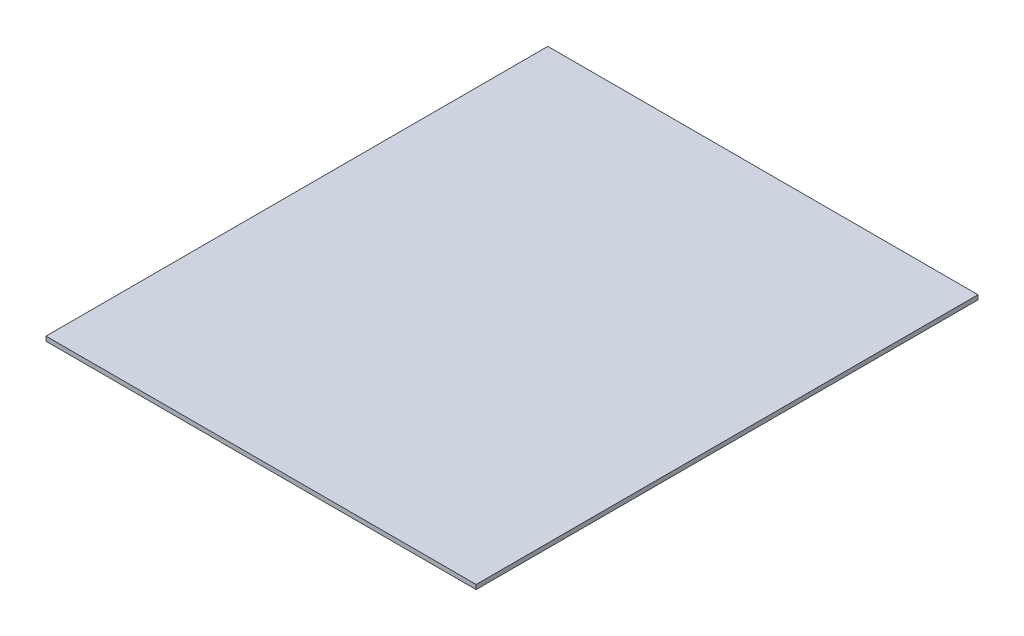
ISO-10303-21;
HEADER;
FILE_DESCRIPTION(('STEP AP214'),'2;1');
FILE_NAME('part.step','',(''),(''),'','','');
FILE_SCHEMA(('AUTOMOTIVE_DESIGN { 1 0 10303 214 1 1 1 1 }'));
ENDSEC;
DATA;
#1=APPLICATION_CONTEXT('core data for automotive mechanical design processes');
#2=APPLICATION_PROTOCOL_DEFINITION('international standard','automotive_design',2000,#1);
#3=PRODUCT_CONTEXT('',#1,'mechanical');
#4=PRODUCT('Part','Part','',(#3));
#5=PRODUCT_RELATED_PRODUCT_CATEGORY('part','',(#4));
#6=PRODUCT_DEFINITION_FORMATION('','',#4);
#7=PRODUCT_DEFINITION_CONTEXT('part definition',#1,'design');
#8=PRODUCT_DEFINITION('design','',#6,#7);
#9=PRODUCT_DEFINITION_SHAPE('','',#8);
#10=(LENGTH_UNIT() NAMED_UNIT(*) SI_UNIT(.MILLI.,.METRE.));
#11=(NAMED_UNIT(*) PLANE_ANGLE_UNIT() SI_UNIT($,.RADIAN.));
#12=(NAMED_UNIT(*) SI_UNIT($,.STERADIAN.) SOLID_ANGLE_UNIT());
#13=UNCERTAINTY_MEASURE_WITH_UNIT(LENGTH_MEASURE(1.E-05),#10,'distance_accuracy_value','');
#14=(GEOMETRIC_REPRESENTATION_CONTEXT(3) GLOBAL_UNCERTAINTY_ASSIGNED_CONTEXT((#13)) GLOBAL_UNIT_ASSIGNED_CONTEXT((#10,
#11,#12)) REPRESENTATION_CONTEXT('',''));
#15=CARTESIAN_POINT('',(0.,0.,0.));
#16=DIRECTION('',(0.,0.,1.));
#17=DIRECTION('',(1.,0.,0.));
#18=AXIS2_PLACEMENT_3D('',#15,#16,#17);
#19=CARTESIAN_POINT('',(-304.8,6.35,-355.6));
#20=DIRECTION('',(1.,0.,0.));
#21=DIRECTION('',(0.,0.,-1.));
#22=AXIS2_PLACEMENT_3D('',#19,#20,#21);
#23=PLANE('',#22);
#24=DIRECTION('',(0.,0.,1.));
#25=VECTOR('',#24,1.);
#26=CARTESIAN_POINT('',(-304.8,0.,-355.6));
#27=LINE('',#26,#25);
#28=CARTESIAN_POINT('',(-304.8,0.,-355.6));
#29=VERTEX_POINT('',#28);
#30=CARTESIAN_POINT('',(-304.8,0.,355.6));
#31=VERTEX_POINT('',#30);
#32=EDGE_CURVE('E96',#29,#31,#27,.T.);
#33=ORIENTED_EDGE('',*,*,#32,.T.);
#34=DIRECTION('',(0.,-1.,0.));
#35=VECTOR('',#34,1.);
#36=CARTESIAN_POINT('',(-304.8,6.35,355.6));
#37=LINE('',#36,#35);
#38=CARTESIAN_POINT('',(-304.8,6.35,355.6));
#39=VERTEX_POINT('',#38);
#40=EDGE_CURVE('E11',#39,#31,#37,.T.);
#41=ORIENTED_EDGE('',*,*,#40,.F.);
#42=DIRECTION('',(0.,0.,1.));
#43=VECTOR('',#42,1.);
#44=CARTESIAN_POINT('',(-304.8,6.35,-355.6));
#45=LINE('',#44,#43);
#46=CARTESIAN_POINT('',(-304.8,6.35,-355.6));
#47=VERTEX_POINT('',#46);
#48=EDGE_CURVE('E84',#47,#39,#45,.T.);
#49=ORIENTED_EDGE('',*,*,#48,.F.);
#50=DIRECTION('',(0.,-1.,0.));
#51=VECTOR('',#50,1.);
#52=CARTESIAN_POINT('',(-304.8,6.35,-355.6));
#53=LINE('',#52,#51);
#54=EDGE_CURVE('E92',#47,#29,#53,.T.);
#55=ORIENTED_EDGE('',*,*,#54,.T.);
#56=EDGE_LOOP('',(#33,#41,#49,#55));
#57=FACE_BOUND('',#56,.T.);
#58=ADVANCED_FACE('F33',(#57),#23,.F.);
#59=CARTESIAN_POINT('',(-304.8,6.35,355.6));
#60=DIRECTION('',(0.,0.,-1.));
#61=DIRECTION('',(-1.,0.,0.));
#62=AXIS2_PLACEMENT_3D('',#59,#60,#61);
#63=PLANE('',#62);
#64=DIRECTION('',(1.,0.,0.));
#65=VECTOR('',#64,1.);
#66=CARTESIAN_POINT('',(-304.8,0.,355.6));
#67=LINE('',#66,#65);
#68=CARTESIAN_POINT('',(304.8,0.,355.6));
#69=VERTEX_POINT('',#68);
#70=EDGE_CURVE('E88',#31,#69,#67,.T.);
#71=ORIENTED_EDGE('',*,*,#70,.T.);
#72=DIRECTION('',(0.,-1.,0.));
#73=VECTOR('',#72,1.);
#74=CARTESIAN_POINT('',(304.8,6.35,355.6));
#75=LINE('',#74,#73);
#76=CARTESIAN_POINT('',(304.8,6.35,355.6));
#77=VERTEX_POINT('',#76);
#78=EDGE_CURVE('E41',#77,#69,#75,.T.);
#79=ORIENTED_EDGE('',*,*,#78,.F.);
#80=DIRECTION('',(1.,0.,0.));
#81=VECTOR('',#80,1.);
#82=CARTESIAN_POINT('',(-304.8,6.35,355.6));
#83=LINE('',#82,#81);
#84=EDGE_CURVE('E79',#39,#77,#83,.T.);
#85=ORIENTED_EDGE('',*,*,#84,.F.);
#86=ORIENTED_EDGE('',*,*,#40,.T.);
#87=EDGE_LOOP('',(#71,#79,#85,#86));
#88=FACE_BOUND('',#87,.T.);
#89=ADVANCED_FACE('F87',(#88),#63,.F.);
#90=CARTESIAN_POINT('',(304.8,6.35,-355.6));
#91=DIRECTION('',(-1.,0.,0.));
#92=DIRECTION('',(0.,0.,1.));
#93=AXIS2_PLACEMENT_3D('',#90,#91,#92);
#94=PLANE('',#93);
#95=DIRECTION('',(0.,0.,-1.));
#96=VECTOR('',#95,1.);
#97=CARTESIAN_POINT('',(304.8,0.,-355.6));
#98=LINE('',#97,#96);
#99=CARTESIAN_POINT('',(304.8,0.,-355.6));
#100=VERTEX_POINT('',#99);
#101=EDGE_CURVE('E66',#69,#100,#98,.T.);
#102=ORIENTED_EDGE('',*,*,#101,.T.);
#103=DIRECTION('',(0.,-1.,0.));
#104=VECTOR('',#103,1.);
#105=CARTESIAN_POINT('',(304.8,6.35,-355.6));
#106=LINE('',#105,#104);
#107=CARTESIAN_POINT('',(304.8,6.35,-355.6));
#108=VERTEX_POINT('',#107);
#109=EDGE_CURVE('E89',#108,#100,#106,.T.);
#110=ORIENTED_EDGE('',*,*,#109,.F.);
#111=DIRECTION('',(0.,0.,-1.));
#112=VECTOR('',#111,1.);
#113=CARTESIAN_POINT('',(304.8,6.35,-355.6));
#114=LINE('',#113,#112);
#115=EDGE_CURVE('E82',#77,#108,#114,.T.);
#116=ORIENTED_EDGE('',*,*,#115,.F.);
#117=ORIENTED_EDGE('',*,*,#78,.T.);
#118=EDGE_LOOP('',(#102,#110,#116,#117));
#119=FACE_BOUND('',#118,.T.);
#120=ADVANCED_FACE('F90',(#119),#94,.F.);
#121=CARTESIAN_POINT('',(-304.8,6.35,-355.6));
#122=DIRECTION('',(0.,0.,1.));
#123=DIRECTION('',(1.,0.,0.));
#124=AXIS2_PLACEMENT_3D('',#121,#122,#123);
#125=PLANE('',#124);
#126=DIRECTION('',(-1.,0.,0.));
#127=VECTOR('',#126,1.);
#128=CARTESIAN_POINT('',(-304.8,0.,-355.6));
#129=LINE('',#128,#127);
#130=EDGE_CURVE('E72',#100,#29,#129,.T.);
#131=ORIENTED_EDGE('',*,*,#130,.T.);
#132=ORIENTED_EDGE('',*,*,#54,.F.);
#133=DIRECTION('',(-1.,0.,0.));
#134=VECTOR('',#133,1.);
#135=CARTESIAN_POINT('',(-304.8,6.35,-355.6));
#136=LINE('',#135,#134);
#137=EDGE_CURVE('E49',#108,#47,#136,.T.);
#138=ORIENTED_EDGE('',*,*,#137,.F.);
#139=ORIENTED_EDGE('',*,*,#109,.T.);
#140=EDGE_LOOP('',(#131,#132,#138,#139));
#141=FACE_BOUND('',#140,.T.);
#142=ADVANCED_FACE('F103',(#141),#125,.F.);
#143=CARTESIAN_POINT('',(0.,6.35,0.));
#144=DIRECTION('',(0.,1.,0.));
#145=DIRECTION('',(0.,0.,1.));
#146=AXIS2_PLACEMENT_3D('',#143,#144,#145);
#147=PLANE('',#146);
#148=ORIENTED_EDGE('',*,*,#48,.T.);
#149=ORIENTED_EDGE('',*,*,#84,.T.);
#150=ORIENTED_EDGE('',*,*,#115,.T.);
#151=ORIENTED_EDGE('',*,*,#137,.T.);
#152=EDGE_LOOP('',(#148,#149,#150,#151));
#153=FACE_BOUND('',#152,.T.);
#154=ADVANCED_FACE('F80',(#153),#147,.T.);
#155=CARTESIAN_POINT('',(0.,0.,0.));
#156=DIRECTION('',(0.,1.,0.));
#157=DIRECTION('',(0.,0.,1.));
#158=AXIS2_PLACEMENT_3D('',#155,#156,#157);
#159=PLANE('',#158);
#160=ORIENTED_EDGE('',*,*,#32,.F.);
#161=ORIENTED_EDGE('',*,*,#130,.F.);
#162=ORIENTED_EDGE('',*,*,#101,.F.);
#163=ORIENTED_EDGE('',*,*,#70,.F.);
#164=EDGE_LOOP('',(#160,#161,#162,#163));
#165=FACE_BOUND('',#164,.T.);
#166=ADVANCED_FACE('F106',(#165),#159,.F.);
#167=CLOSED_SHELL('',(#58,#89,#120,#142,#154,#166));
#168=MANIFOLD_SOLID_BREP('B2',#167);
#169=ADVANCED_BREP_SHAPE_REPRESENTATION('',(#18,#168),#14);
#170=SHAPE_DEFINITION_REPRESENTATION(#9,#169);
ENDSEC;
END-ISO-10303-21;
